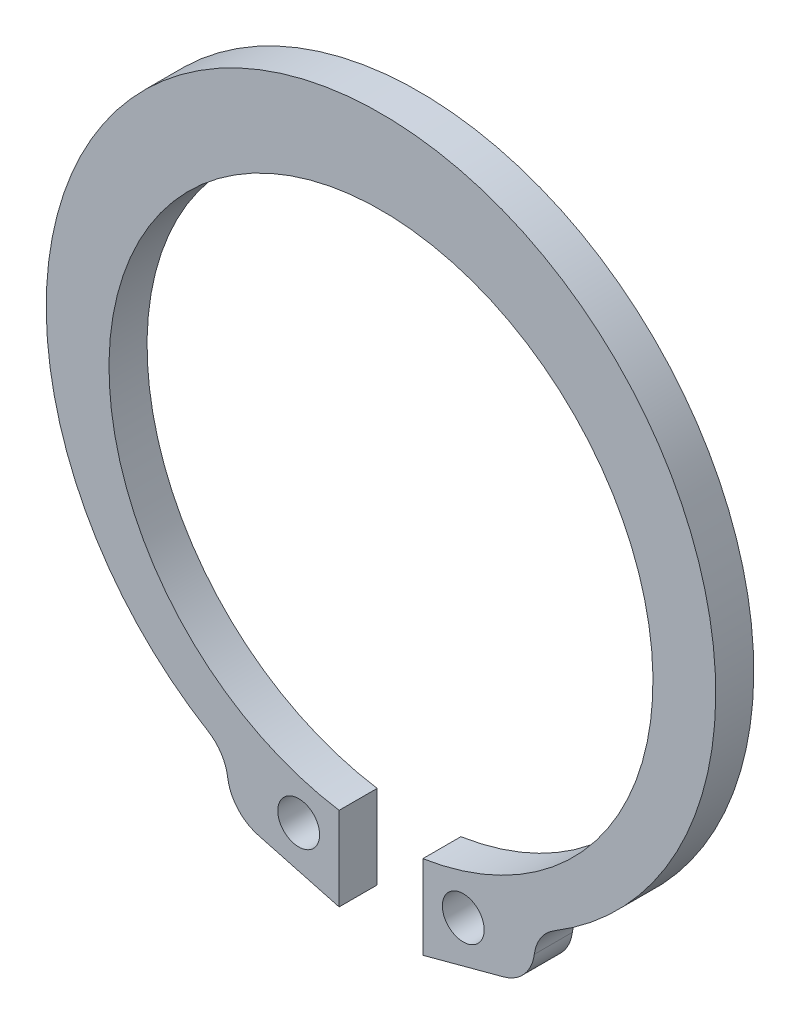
from build123d import *

# Parameters (mm, degrees)
ESQUISSE1_R           = 0.55
ANNEAU_LASTIQUE_DEPTH = 0.5


with BuildPart() as part:
    # Esquisse1 → Anneau _lastique (new, symmetric)
    with BuildSketch(Plane.XY):
        with BuildLine():
            Line((-1.1, -7.064877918), (-1.1, -9.264877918))
            Line((-1.1, -9.264877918), (-3.225036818, -8.695476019))
            ThreePointArc((-3.225036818, -8.695476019), (-3.766962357, -8.35869079), (-4.030767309, -7.777730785))
            ThreePointArc((-4.030767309, -7.777730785), (-4.200820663, -7.320088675), (-4.552176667, -6.981114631))
            ThreePointArc((-4.552176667, -6.981114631), (0, 9.35), (4.552176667, -6.981114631))
            ThreePointArc((4.552176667, -6.981114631), (4.200820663, -7.320088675), (4.030767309, -7.777730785))
            ThreePointArc((4.030767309, -7.777730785), (3.766962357, -8.35869079), (3.225036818, -8.695476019))
            Line((3.225036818, -8.695476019), (1.1, -9.264877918))
            Line((1.1, -9.264877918), (1.1, -7.064877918))
            ThreePointArc((1.1, -7.064877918), (0, 7.15), (-1.1, -7.064877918))
        make_face()
        with Locations((-2.162518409, -7.880176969)):
            Circle(ESQUISSE1_R, mode=Mode.SUBTRACT)
        with Locations(Location((2.162518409, -7.880176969, 0), (0, 0, 180))):
            Circle(ESQUISSE1_R, mode=Mode.SUBTRACT)
    extrude(amount=ANNEAU_LASTIQUE_DEPTH, both=True)


solid = part.part
